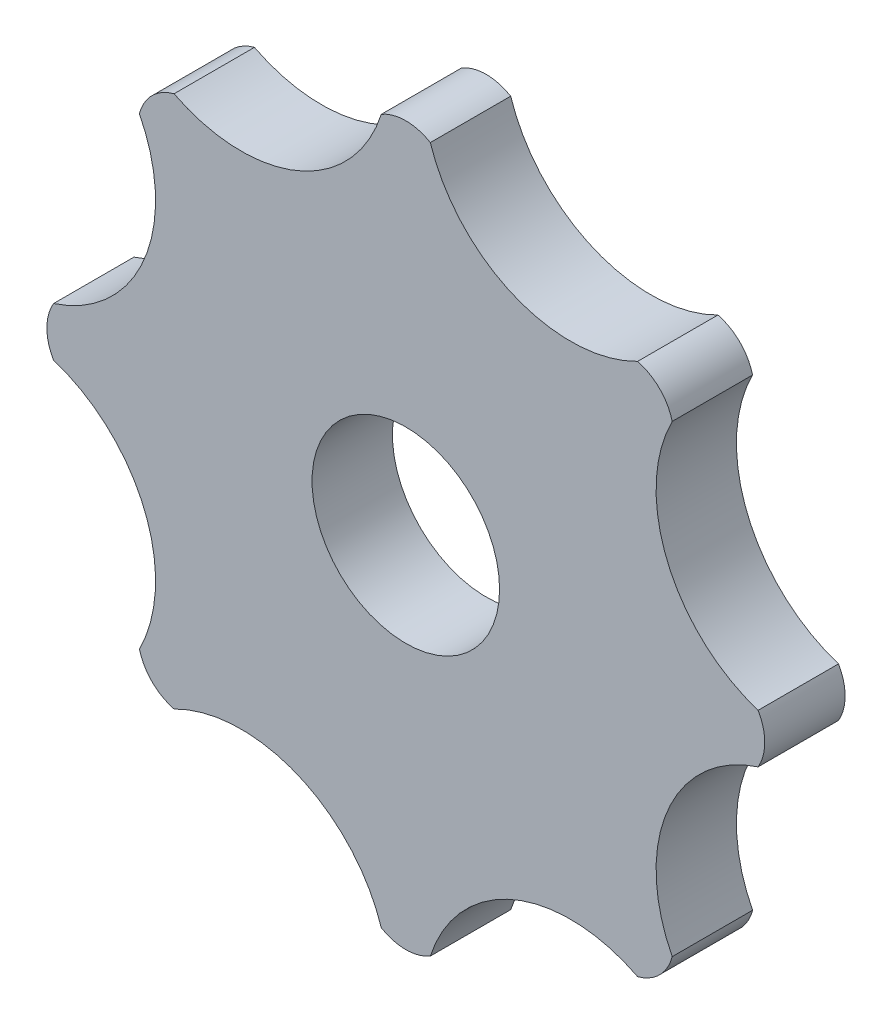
from build123d import *

# Parameters (mm, degrees)
BASE_EXTRUSION_DEPTH    = 3
ESQUISSE2_R             = 3.5
ENL_V_MAT_EXTRU_1_DEPTH = 20.186453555


with BuildPart() as part:
    # Esquisse1 → Base-Extrusion (new body)
    with BuildSketch(Plane.XY):
        with BuildLine():
            ThreePointArc((9.945358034, 8.652140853), (9.765448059, 9.095188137), (9.475230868, 9.475230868))
            ThreePointArc((9.475230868, 9.475230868), (9.095188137, 9.765448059), (8.652140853, 9.945358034))
            ThreePointArc((8.652140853, 9.945358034), (4.043050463, 9.760787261), (0.914442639, 13.150417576))
            ThreePointArc((0.914442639, 13.150417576), (0.473945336, 13.336483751), (0, 13.4))
            ThreePointArc((0, 13.4), (-0.473945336, 13.336483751), (-0.914442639, 13.150417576))
            ThreePointArc((-0.914442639, 13.150417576), (-4.043050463, 9.760787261), (-8.652140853, 9.945358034))
            ThreePointArc((-8.652140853, 9.945358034), (-9.095188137, 9.765448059), (-9.475230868, 9.475230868))
            ThreePointArc((-9.475230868, 9.475230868), (-9.765448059, 9.095188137), (-9.945358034, 8.652140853))
            ThreePointArc((-9.945358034, 8.652140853), (-9.760787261, 4.043050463), (-13.150417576, 0.914442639))
            ThreePointArc((-13.150417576, 0.914442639), (-13.336483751, 0.473945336), (-13.4, 0))
            ThreePointArc((-13.4, 0), (-13.336483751, -0.473945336), (-13.150417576, -0.914442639))
            ThreePointArc((-13.150417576, -0.914442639), (-9.760787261, -4.043050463), (-9.945358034, -8.652140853))
            ThreePointArc((-9.945358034, -8.652140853), (-9.765448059, -9.095188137), (-9.475230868, -9.475230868))
            ThreePointArc((-9.475230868, -9.475230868), (-9.095188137, -9.765448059), (-8.652140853, -9.945358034))
            ThreePointArc((-8.652140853, -9.945358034), (-4.043050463, -9.760787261), (-0.914442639, -13.150417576))
            ThreePointArc((-0.914442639, -13.150417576), (-0.473945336, -13.336483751), (0, -13.4))
            ThreePointArc((0, -13.4), (0.473945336, -13.336483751), (0.914442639, -13.150417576))
            ThreePointArc((0.914442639, -13.150417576), (4.043050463, -9.760787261), (8.652140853, -9.945358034))
            ThreePointArc((8.652140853, -9.945358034), (9.095188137, -9.765448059), (9.475230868, -9.475230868))
            ThreePointArc((9.475230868, -9.475230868), (9.765448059, -9.095188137), (9.945358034, -8.652140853))
            ThreePointArc((9.945358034, -8.652140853), (9.760787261, -4.043050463), (13.150417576, -0.914442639))
            ThreePointArc((13.150417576, -0.914442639), (13.336483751, -0.473945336), (13.4, 0))
            ThreePointArc((13.4, 0), (13.336483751, 0.473945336), (13.150417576, 0.914442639))
            ThreePointArc((13.150417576, 0.914442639), (9.760787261, 4.043050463), (9.945358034, 8.652140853))
        make_face()
    extrude(amount=BASE_EXTRUSION_DEPTH)

    # Esquisse2 → Enl_v. mat.-Extru.1 (cut, through all)
    with BuildSketch(Plane.XY.offset(3)):
        Circle(ESQUISSE2_R)
    extrude(amount=-ENL_V_MAT_EXTRU_1_DEPTH, mode=Mode.SUBTRACT)


solid = part.part
